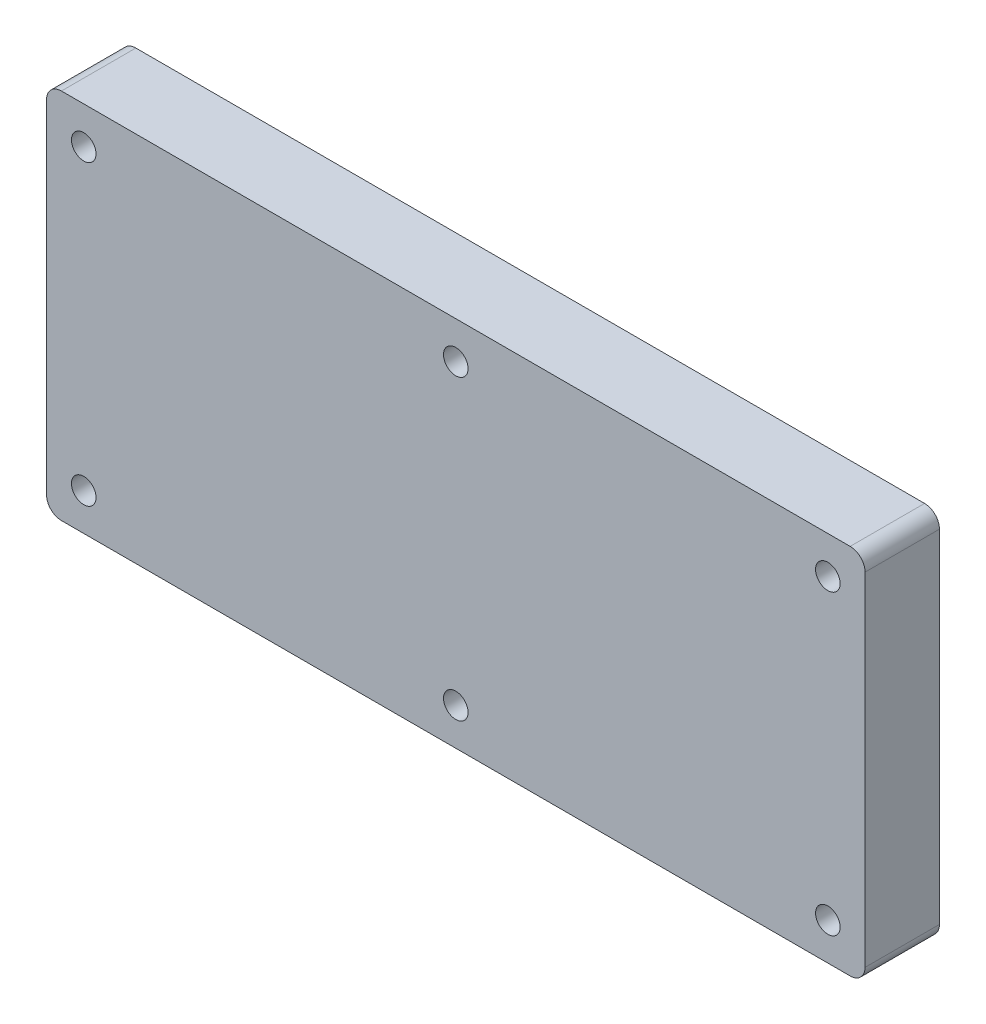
from build123d import *

# Parameters (mm, degrees)
SKETCH_1_W         = 110
SKETCH_1_H         = 50
EXTRUDE_1_DEPTH    = 10
HOLE_WIZARD_M4_1_D = 3.3
FILLET_1_R         = 2


with BuildPart() as part:
    # Sketch 1 → Extrude 1 (new body)
    with BuildSketch(Plane.XY):
        Rectangle(SKETCH_1_W, SKETCH_1_H)
    extrude(amount=EXTRUDE_1_DEPTH)

    # Hole Wizard M4 _1 (through all)
    with Locations(Plane.XY.offset(10)):
        with Locations((-50, 20), (0, 20), (50, 20), (-50, -20), (0, -20), (50, -20)):
            Hole(HOLE_WIZARD_M4_1_D / 2)

    # Fillet 1
    fillet_1_edges = [part.edges().sort_by_distance(p)[0] for p in [
        (55, -25, 5),
        (-55, -25, 5),
        (-55, 25, 5),
        (55, 25, 5),
    ]]
    fillet(fillet_1_edges, radius=FILLET_1_R)


solid = part.part
